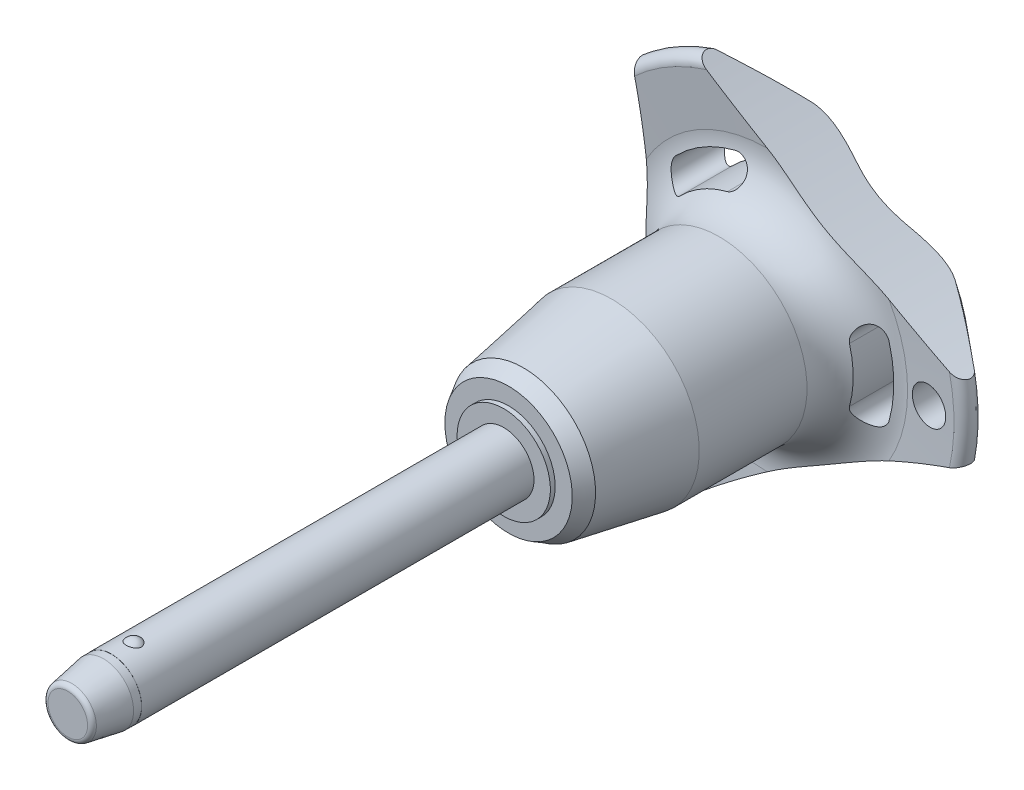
from build123d import *

# Parameters (mm, degrees)
SKETCH1_R           = 2.5
BOSS_EXTRUDE1_DEPTH = 30
SKETCH2_R           = 2.1
BOSS_EXTRUDE2_DEPTH = 26.7
BOSS_EXTRUDE3_START = 6
SKETCH1_2_R         = 2.5
BOSS_EXTRUDE3_DEPTH = 6
CHAMFER1_SIZE       = 3
CHAMFER1_SIZE2      = 0.528980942
FILLET1_R           = 0.4
SKETCH6_R           = 79.96
CUT_EXTRUDE1_DEPTH  = 62.368512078
CIRPATTERN1_COUNT   = 3
SKETCH7_R           = 1.5
CUT_EXTRUDE2_DEPTH  = 62.119983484
SKETCH8_R           = 2.5
SKETCH8_R_2         = 2.49
CUT_EXTRUDE3_DEPTH  = 3.6


with BuildPart() as part:
    # Sketch1 → Boss-Extrude1 (new body)
    with BuildSketch(Plane.XY):
        Circle(SKETCH1_R)
    extrude(amount=-BOSS_EXTRUDE1_DEPTH)

    # Sketch2 → Boss-Extrude2 (add)
    with BuildSketch(Plane(origin=(0, 0, -30), x_dir=(-1, 0, 0), z_dir=(0, 0, -1))):
        Circle(SKETCH2_R)
    extrude(amount=BOSS_EXTRUDE2_DEPTH)

    # Sketch3 → Revolve1 (revolve)
    with BuildSketch(Plane(origin=(0, 0, 0), x_dir=(0, 0, -1), z_dir=(1, 0, 0))):
        with BuildLine():
            Line((-0.580947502, 2.75), (-0.580947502, 1.15))
            ThreePointArc((-0.580947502, 1.15), (0.219052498, 1.95), (-0.580947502, 2.75))
        make_face()
        with BuildLine():
            Line((-0.580947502, -1.15), (-0.580947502, -2.75))
            ThreePointArc((-0.580947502, -2.75), (0.219052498, -1.95), (-0.580947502, -1.15))
        make_face()
    revolve(axis=Axis((0, -1.15, 0.580947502), (0, 1, 0)))

    # Sketch1_2 → Boss-Extrude3 (add)
    with BuildSketch(Plane.XY.offset(BOSS_EXTRUDE3_START)):
        Circle(SKETCH1_2_R)
    extrude(amount=-BOSS_EXTRUDE3_DEPTH)

    # Chamfer1
    chamfer1_edges = [part.edges().sort_by_distance(p)[0] for p in [
        (-2.5, 0, 6),
    ]]
    chamfer1_side = [part.faces().sort_by_distance(p)[0] for p in [
        (-2.5, 0, -12),
    ]]
    chamfer(chamfer1_edges, length=CHAMFER1_SIZE, length2=CHAMFER1_SIZE2, reference=chamfer1_side[0])

    # Fillet1
    fillet1_edges = [part.edges().sort_by_distance(p)[0] for p in [
        (-1.971019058, 0, 6),
        (2.1, 0, -56.7),
    ]]
    fillet(fillet1_edges, radius=FILLET1_R)

    # Sketch4 → Revolve2 (revolve)
    with BuildSketch(Plane(origin=(0, 0, 0), x_dir=(0, 0, -1), z_dir=(1, 0, 0)), mode=Mode.PRIVATE) as revolve2_sk:
        Polygon((30, 0), (30, 3.851837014), (30.4, 3.851837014), (30.4, 5.26161122), (31.620900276, 5.966498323), (38.9, 7.25), (47.8, 7.25), (47.8, 0), align=None)
    revolve(revolve2_sk.sketch.rotate(Axis((0, 0, -47.8), (0, 0, 1)), 90), axis=Axis((0, 0, -47.8), (0, 0, 1)))

    # Sketch5 → Revolve3 (revolve)
    with BuildSketch(Plane(origin=(0, 0, 0), x_dir=(0, 0, -1), z_dir=(1, 0, 0)), mode=Mode.PRIVATE) as revolve3_sk:
        with BuildLine():
            Line((51.78715932, 11.570250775), (51.452568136, 15.735949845))
            ThreePointArc((51.452568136, 15.735949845), (51.946485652, 16.540188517), (52.862835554, 16.314230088))
            Line((52.862835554, 16.314230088), (56.326414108, 12.186497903))
            ThreePointArc((56.326414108, 12.186497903), (56.7, 11.109282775), (56.261488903, 10.056825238))
            ThreePointArc((56.261488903, 10.056825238), (53.289873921, 5.413681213), (52.25, 0))
            Line((52.25, 0), (47.8, 0))
            Line((47.8, 0), (47.8, 7.25))
            ThreePointArc((47.8, 7.25), (50.739473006, 8.537160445), (51.78715932, 11.570250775))
        make_face()
    revolve(revolve3_sk.sketch.rotate(Axis((0, 0, -52.25), (0, 0, 1)), 90), axis=Axis((0, 0, -52.25), (0, 0, 1)))

    # Sketch6 → Cut-Extrude1 (cut, through all)
    with BuildSketch(Plane.XY):
        with Locations((-89.76, 0)):
            Circle(SKETCH6_R)
        with BuildLine():
            ThreePointArc((10.099921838, -2.834717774), (10.490188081, 0), (10.099921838, 2.834717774))
            ThreePointArc((10.099921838, 2.834717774), (8.768180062, 3.582738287), (8.020159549, 2.250996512))
            ThreePointArc((8.020159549, 2.250996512), (8.330062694, 0), (8.020159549, -2.250996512))
            ThreePointArc((8.020159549, -2.250996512), (8.768180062, -3.582738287), (10.099921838, -2.834717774))
        make_face()
    cut_extrude1 = extrude(amount=-CUT_EXTRUDE1_DEPTH, mode=Mode.SUBTRACT)

    # CirPattern1: Cut-Extrude1 ×3 about axis
    cirpattern1_axis = Axis((0, 0, 0), (0, 0, 1))
    for i in range(1, CIRPATTERN1_COUNT):
        add(cut_extrude1.rotate(cirpattern1_axis, i * 360 / CIRPATTERN1_COUNT), mode=Mode.SUBTRACT)

    # Sketch7 → Cut-Extrude2 (cut, through all)
    with BuildSketch(Plane.XY):
        with Locations(Location((13.490188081, 0, 0), (0, 0, 225.221865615))):
            Circle(SKETCH7_R)
    extrude(amount=-CUT_EXTRUDE2_DEPTH, mode=Mode.SUBTRACT)

    # Sketch8 → Cut-Extrude3 (cut)
    with BuildSketch(Plane.XY.offset(6)):
        Circle(SKETCH8_R)
        Circle(SKETCH8_R_2, mode=Mode.SUBTRACT)
    extrude(amount=-CUT_EXTRUDE3_DEPTH, mode=Mode.SUBTRACT)


solid = part.part
